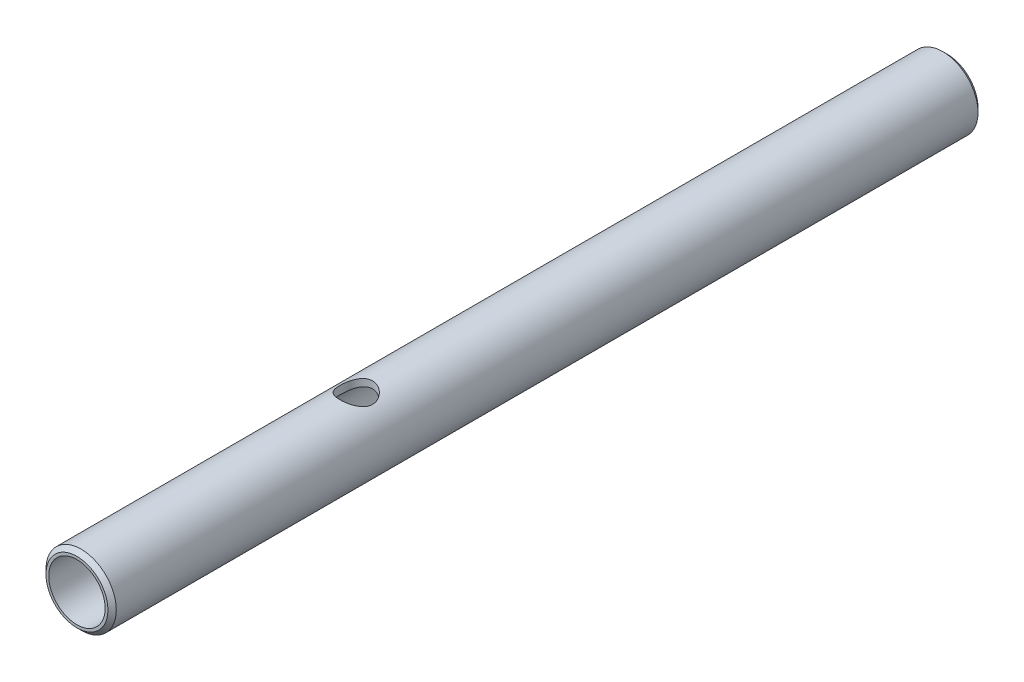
from build123d import *

# Parameters (mm, degrees)
SKETCH1_R           = 10.668
SKETCH1_R_2         = 8.5598
BOSS_EXTRUDE1_DEPTH = 263.906
CHAMFER1_SIZE       = 1.27
SKETCH2_R           = 4.96062
CUT_EXTRUDE1_DEPTH  = 265.336885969


with BuildPart() as part:
    # Sketch1 → Boss-Extrude1 (new body)
    with BuildSketch(Plane.XY):
        Circle(SKETCH1_R)
        Circle(SKETCH1_R_2, mode=Mode.SUBTRACT)
    extrude(amount=BOSS_EXTRUDE1_DEPTH)

    # Chamfer1
    chamfer1_edges = [part.edges().sort_by_distance(p)[0] for p in [
        (-10.668, 0, 263.906),
        (-10.668, 0, 0),
    ]]
    chamfer(chamfer1_edges, length=CHAMFER1_SIZE)

    # Sketch2 → Cut-Extrude1 (cut, through all)
    with BuildSketch(Plane(origin=(0, 0, 0), x_dir=(1, 0, 0), z_dir=(0, 1, 0))):
        with Locations(Location((0, -179.199731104, 0), (0, 0, 90))):
            Circle(SKETCH2_R)
    extrude(amount=CUT_EXTRUDE1_DEPTH, mode=Mode.SUBTRACT)


solid = part.part
